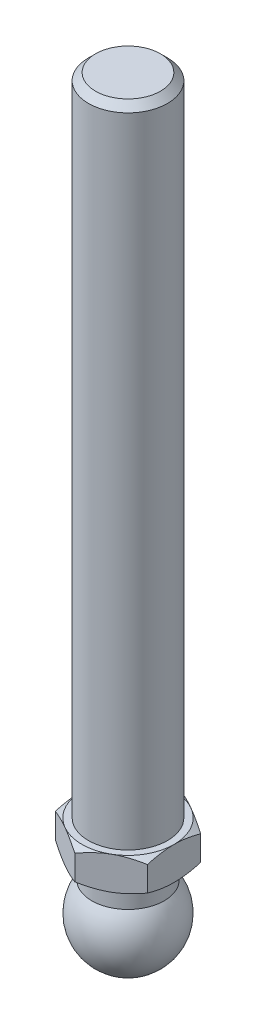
ISO-10303-21;
HEADER;
FILE_DESCRIPTION(('STEP AP214'),'2;1');
FILE_NAME('part.step','',(''),(''),'','','');
FILE_SCHEMA(('AUTOMOTIVE_DESIGN { 1 0 10303 214 1 1 1 1 }'));
ENDSEC;
DATA;
#1=APPLICATION_CONTEXT('core data for automotive mechanical design processes');
#2=APPLICATION_PROTOCOL_DEFINITION('international standard','automotive_design',2000,#1);
#3=PRODUCT_CONTEXT('',#1,'mechanical');
#4=PRODUCT('Part','Part','',(#3));
#5=PRODUCT_RELATED_PRODUCT_CATEGORY('part','',(#4));
#6=PRODUCT_DEFINITION_FORMATION('','',#4);
#7=PRODUCT_DEFINITION_CONTEXT('part definition',#1,'design');
#8=PRODUCT_DEFINITION('design','',#6,#7);
#9=PRODUCT_DEFINITION_SHAPE('','',#8);
#10=(LENGTH_UNIT() NAMED_UNIT(*) SI_UNIT(.MILLI.,.METRE.));
#11=(NAMED_UNIT(*) PLANE_ANGLE_UNIT() SI_UNIT($,.RADIAN.));
#12=(NAMED_UNIT(*) SI_UNIT($,.STERADIAN.) SOLID_ANGLE_UNIT());
#13=UNCERTAINTY_MEASURE_WITH_UNIT(LENGTH_MEASURE(1.E-05),#10,'distance_accuracy_value','');
#14=(GEOMETRIC_REPRESENTATION_CONTEXT(3) GLOBAL_UNCERTAINTY_ASSIGNED_CONTEXT((#13)) GLOBAL_UNIT_ASSIGNED_CONTEXT((#10,
#11,#12)) REPRESENTATION_CONTEXT('',''));
#15=CARTESIAN_POINT('',(0.,0.,0.));
#16=DIRECTION('',(0.,0.,1.));
#17=DIRECTION('',(1.,0.,0.));
#18=AXIS2_PLACEMENT_3D('',#15,#16,#17);
#19=CARTESIAN_POINT('',(0.,19.5,0.));
#20=DIRECTION('',(0.,-1.,0.));
#21=DIRECTION('',(0.,0.,-1.));
#22=AXIS2_PLACEMENT_3D('',#19,#20,#21);
#23=CONICAL_SURFACE('',#22,7.,1.0471975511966);
#24=CARTESIAN_POINT('',(-7.,15.2688336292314,12.5023453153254));
#25=CARTESIAN_POINT('',(-7.,15.4184696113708,12.2052647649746));
#26=CARTESIAN_POINT('',(-7.,15.5671267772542,11.9076861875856));
#27=CARTESIAN_POINT('',(-7.,15.8620076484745,11.3113035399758));
#28=CARTESIAN_POINT('',(-7.,16.0082312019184,11.0124993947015));
#29=CARTESIAN_POINT('',(-7.,16.2980281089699,10.4128982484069));
#30=CARTESIAN_POINT('',(-7.,16.441595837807,10.1120985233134));
#31=CARTESIAN_POINT('',(-7.,16.7251296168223,9.50881013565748));
#32=CARTESIAN_POINT('',(-7.,16.8650957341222,9.20632150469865));
#33=CARTESIAN_POINT('',(-7.,17.1470427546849,8.58510325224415));
#34=CARTESIAN_POINT('',(-7.,17.2888108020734,8.26627671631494));
#35=CARTESIAN_POINT('',(-7.,17.5662200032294,7.62594250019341));
#36=CARTESIAN_POINT('',(-7.,17.7018608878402,7.30443470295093));
#37=CARTESIAN_POINT('',(-7.,17.9652496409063,6.65840905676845));
#38=CARTESIAN_POINT('',(-7.,18.0930022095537,6.33389313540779));
#39=CARTESIAN_POINT('',(-7.,18.3384540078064,5.68109770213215));
#40=CARTESIAN_POINT('',(-7.,18.4561543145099,5.35281859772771));
#41=CARTESIAN_POINT('',(-7.,18.7028165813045,4.61998548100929));
#42=CARTESIAN_POINT('',(-7.,18.8286623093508,4.21436746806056));
#43=CARTESIAN_POINT('',(-7.,19.0543524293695,3.39574912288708));
#44=CARTESIAN_POINT('',(-7.,19.1541980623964,2.98274914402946));
#45=CARTESIAN_POINT('',(-7.,19.2776062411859,2.36178861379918));
#46=CARTESIAN_POINT('',(-7.,19.3141378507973,2.15638627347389));
#47=CARTESIAN_POINT('',(-7.,19.3780104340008,1.74416917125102));
#48=CARTESIAN_POINT('',(-7.,19.4053527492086,1.53735462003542));
#49=CARTESIAN_POINT('',(-7.,19.4500375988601,1.1227076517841));
#50=CARTESIAN_POINT('',(-7.,19.467383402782,0.914875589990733));
#51=CARTESIAN_POINT('',(-7.,19.4915250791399,0.498594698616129));
#52=CARTESIAN_POINT('',(-7.,19.4983210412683,0.290145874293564));
#53=CARTESIAN_POINT('',(-7.,19.5011397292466,-0.128421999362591));
#54=CARTESIAN_POINT('',(-7.,19.4970795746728,-0.338541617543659));
#55=CARTESIAN_POINT('',(-7.,19.4781521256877,-0.758289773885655));
#56=CARTESIAN_POINT('',(-7.,19.463284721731,-0.967918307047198));
#57=CARTESIAN_POINT('',(-7.,19.4232345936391,-1.38625975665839));
#58=CARTESIAN_POINT('',(-7.,19.3980479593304,-1.59497229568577));
#59=CARTESIAN_POINT('',(-7.,19.3381380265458,-2.01100790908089));
#60=CARTESIAN_POINT('',(-7.,19.3034145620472,-2.21833095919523));
#61=CARTESIAN_POINT('',(-7.,19.1849408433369,-2.84522045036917));
#62=CARTESIAN_POINT('',(-7.,19.0876569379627,-3.26225118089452));
#63=CARTESIAN_POINT('',(-7.,18.8658468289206,-4.08879182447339));
#64=CARTESIAN_POINT('',(-7.,18.7413180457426,-4.4983010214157));
#65=CARTESIAN_POINT('',(-7.,18.4953846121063,-5.2406101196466));
#66=CARTESIAN_POINT('',(-7.,18.3771372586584,-5.5744719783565));
#67=CARTESIAN_POINT('',(-7.,18.1300009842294,-6.23825206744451));
#68=CARTESIAN_POINT('',(-7.,18.0011107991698,-6.56816982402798));
#69=CARTESIAN_POINT('',(-7.,17.7350197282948,-7.22486424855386));
#70=CARTESIAN_POINT('',(-7.,17.5978135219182,-7.55163874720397));
#71=CARTESIAN_POINT('',(-7.,17.3169731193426,-8.20238370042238));
#72=CARTESIAN_POINT('',(-7.,17.1733392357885,-8.5263542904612));
#73=CARTESIAN_POINT('',(-7.,16.8876445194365,-9.15729037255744));
#74=CARTESIAN_POINT('',(-7.,16.7458097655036,-9.46435857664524));
#75=CARTESIAN_POINT('',(-7.,16.4583976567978,-10.0767426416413));
#76=CARTESIAN_POINT('',(-7.,16.3128202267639,-10.3820584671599));
#77=CARTESIAN_POINT('',(-7.,16.018926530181,-10.990585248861));
#78=CARTESIAN_POINT('',(-7.,15.8706165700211,-11.2937992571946));
#79=CARTESIAN_POINT('',(-7.,15.5714843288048,-11.8989613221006));
#80=CARTESIAN_POINT('',(-7.,15.4206622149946,-12.2009094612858));
#81=CARTESIAN_POINT('',(-7.,15.2688336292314,-12.5023453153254));
#82=B_SPLINE_CURVE_WITH_KNOTS('',3,(#24,#25,#26,#27,#28,#29,#30,#31,#32,#33,#34,#35,#36,#37,#38,
#39,#40,#41,#42,#43,#44,#45,#46,#47,#48,#49,#50,#51,#52,#53,#54,#55,#56,#57,#58,#59,#60,#61,#62,
#63,#64,#65,#66,#67,#68,#69,#70,#71,#72,#73,#74,#75,#76,#77,#78,#79,#80,#81),.UNSPECIFIED.,.F.,
.F.,(4,2,2,2,2,2,2,2,2,2,2,2,2,2,2,2,2,2,2,2,2,2,2,2,2,2,2,2,4),(0.,0.997917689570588,
1.99589743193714,2.99579247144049,3.99566886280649,5.04239250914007,6.08916209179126,
7.13530182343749,8.18132932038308,9.45480706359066,10.7282240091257,11.3539282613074,
11.9795411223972,12.6049492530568,13.2303520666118,13.8605430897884,14.490740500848,
15.1211769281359,15.7516243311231,17.0349275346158,18.3183522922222,19.380686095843,
20.4431462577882,21.506293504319,22.5693890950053,23.5840866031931,24.5988045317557,
25.6114179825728,26.6239642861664),.UNSPECIFIED.);
#83=CARTESIAN_POINT('',(-7.,18.8747852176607,4.04145188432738));
#84=VERTEX_POINT('',#83);
#85=CARTESIAN_POINT('',(-7.,19.5,0.));
#86=VERTEX_POINT('',#85);
#87=EDGE_CURVE('E359',#84,#86,#82,.T.);
#88=ORIENTED_EDGE('',*,*,#87,.F.);
#89=CARTESIAN_POINT('',(0.0002,18.8747185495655,8.0830192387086));
#90=CARTESIAN_POINT('',(-0.153667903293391,18.9260001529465,7.99418356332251));
#91=CARTESIAN_POINT('',(-0.30810950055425,18.9749544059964,7.90501666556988));
#92=CARTESIAN_POINT('',(-0.618246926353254,19.0675672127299,7.72595873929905));
#93=CARTESIAN_POINT('',(-0.773943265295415,19.1112234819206,7.63606741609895));
#94=CARTESIAN_POINT('',(-1.24352516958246,19.2333884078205,7.36495417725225));
#95=CARTESIAN_POINT('',(-1.5592643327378,19.302874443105,7.18266208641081));
#96=CARTESIAN_POINT('',(-2.03176224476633,19.3843550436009,6.9098652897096));
#97=CARTESIAN_POINT('',(-2.18710922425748,19.4075665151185,6.82017566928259));
#98=CARTESIAN_POINT('',(-2.49850511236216,19.4464887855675,6.64039116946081));
#99=CARTESIAN_POINT('',(-2.65455395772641,19.4622002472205,6.55029632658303));
#100=CARTESIAN_POINT('',(-2.96692267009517,19.4857220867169,6.36995016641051));
#101=CARTESIAN_POINT('',(-3.12324202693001,19.4935414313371,6.27969914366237));
#102=CARTESIAN_POINT('',(-3.43601650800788,19.5011197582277,6.09911871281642));
#103=CARTESIAN_POINT('',(-3.59247162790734,19.500878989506,6.00878930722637));
#104=CARTESIAN_POINT('',(-4.02110687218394,19.4891402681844,5.76131663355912));
#105=CARTESIAN_POINT('',(-4.2931466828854,19.4694342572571,5.60425437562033));
#106=CARTESIAN_POINT('',(-4.83541944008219,19.4069465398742,5.29117305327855));
#107=CARTESIAN_POINT('',(-5.10565047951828,19.364143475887,5.13515508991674));
#108=CARTESIAN_POINT('',(-5.64901454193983,19.2571483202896,4.82144370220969));
#109=CARTESIAN_POINT('',(-5.92207900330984,19.1925029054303,4.66378986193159));
#110=CARTESIAN_POINT('',(-6.46413578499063,19.045783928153,4.35083323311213));
#111=CARTESIAN_POINT('',(-6.73313504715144,18.9637448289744,4.19552643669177));
#112=CARTESIAN_POINT('',(-7.0002,18.8747185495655,4.04133641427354));
#113=B_SPLINE_CURVE_WITH_KNOTS('',3,(#89,#90,#91,#92,#93,#94,#95,#96,#97,#98,#99,#100,#101,#102,
#103,#104,#105,#106,#107,#108,#109,#110,#111,#112),.UNSPECIFIED.,.F.,.F.,(4,2,2,2,2,2,2,2,2,2,2,
4),(0.,0.554727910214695,1.10969417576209,2.2219327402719,2.76443041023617,3.30688013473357,
3.8487128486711,4.39052882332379,5.33376515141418,6.27787517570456,7.2429241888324,
8.20607866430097),.UNSPECIFIED.);
#114=CARTESIAN_POINT('',(-3.5,19.5,6.06217782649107));
#115=VERTEX_POINT('',#114);
#116=EDGE_CURVE('E148',#115,#84,#113,.T.);
#117=ORIENTED_EDGE('',*,*,#116,.F.);
#118=CARTESIAN_POINT('',(0.,19.5,0.));
#119=DIRECTION('',(0.,-1.,0.));
#120=DIRECTION('',(0.,0.,-1.));
#121=AXIS2_PLACEMENT_3D('',#118,#119,#120);
#122=CIRCLE('',#121,7.);
#123=EDGE_CURVE('E317',#115,#86,#122,.T.);
#124=ORIENTED_EDGE('',*,*,#123,.T.);
#125=EDGE_LOOP('',(#88,#117,#124));
#126=FACE_BOUND('',#125,.T.);
#127=ADVANCED_FACE('F18',(#126),#23,.T.);
#128=CARTESIAN_POINT('',(-7.,18.8747852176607,-4.04145188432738));
#129=VERTEX_POINT('',#128);
#130=EDGE_CURVE('E213',#86,#129,#82,.T.);
#131=ORIENTED_EDGE('',*,*,#130,.F.);
#132=CARTESIAN_POINT('',(-3.5,19.5,-6.06217782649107));
#133=VERTEX_POINT('',#132);
#134=EDGE_CURVE('E340',#86,#133,#122,.T.);
#135=ORIENTED_EDGE('',*,*,#134,.T.);
#136=CARTESIAN_POINT('',(-7.0002,18.8747185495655,-4.04133641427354));
#137=CARTESIAN_POINT('',(-6.84633209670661,18.9260001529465,-4.13017208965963));
#138=CARTESIAN_POINT('',(-6.69189049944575,18.9749544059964,-4.21933898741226));
#139=CARTESIAN_POINT('',(-6.38175307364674,19.0675672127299,-4.39839691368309));
#140=CARTESIAN_POINT('',(-6.22605673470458,19.1112234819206,-4.48828823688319));
#141=CARTESIAN_POINT('',(-5.75647483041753,19.2333884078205,-4.75940147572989));
#142=CARTESIAN_POINT('',(-5.4407356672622,19.302874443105,-4.94169356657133));
#143=CARTESIAN_POINT('',(-4.96823775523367,19.3843550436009,-5.21449036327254));
#144=CARTESIAN_POINT('',(-4.81289077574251,19.4075665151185,-5.30417998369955));
#145=CARTESIAN_POINT('',(-4.50149488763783,19.4464887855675,-5.48396448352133));
#146=CARTESIAN_POINT('',(-4.34544604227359,19.4622002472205,-5.57405932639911));
#147=CARTESIAN_POINT('',(-4.03307732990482,19.4857220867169,-5.75440548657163));
#148=CARTESIAN_POINT('',(-3.87675797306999,19.4935414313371,-5.84465650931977));
#149=CARTESIAN_POINT('',(-3.56398349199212,19.5011197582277,-6.02523694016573));
#150=CARTESIAN_POINT('',(-3.40752837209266,19.500878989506,-6.11556634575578));
#151=CARTESIAN_POINT('',(-2.97889312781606,19.4891402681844,-6.36303901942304));
#152=CARTESIAN_POINT('',(-2.7068533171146,19.4694342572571,-6.52010127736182));
#153=CARTESIAN_POINT('',(-2.1645805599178,19.4069465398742,-6.83318259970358));
#154=CARTESIAN_POINT('',(-1.89434952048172,19.364143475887,-6.9892005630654));
#155=CARTESIAN_POINT('',(-1.35098545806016,19.2571483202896,-7.30291195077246));
#156=CARTESIAN_POINT('',(-1.07792099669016,19.1925029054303,-7.46056579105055));
#157=CARTESIAN_POINT('',(-0.53586421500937,19.045783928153,-7.77352241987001));
#158=CARTESIAN_POINT('',(-0.26686495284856,18.9637448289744,-7.92882921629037));
#159=CARTESIAN_POINT('',(0.000200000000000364,18.8747185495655,-8.0830192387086));
#160=B_SPLINE_CURVE_WITH_KNOTS('',3,(#136,#137,#138,#139,#140,#141,#142,#143,#144,#145,#146,
#147,#148,#149,#150,#151,#152,#153,#154,#155,#156,#157,#158,#159),.UNSPECIFIED.,.F.,.F.,(4,2,2,
2,2,2,2,2,2,2,2,4),(0.,0.554727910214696,1.10969417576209,2.2219327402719,2.76443041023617,
3.30688013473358,3.8487128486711,4.39052882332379,5.33376515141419,6.27787517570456,
7.2429241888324,8.20607866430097),.UNSPECIFIED.);
#161=EDGE_CURVE('E205',#129,#133,#160,.T.);
#162=ORIENTED_EDGE('',*,*,#161,.F.);
#163=EDGE_LOOP('',(#131,#135,#162));
#164=FACE_BOUND('',#163,.T.);
#165=ADVANCED_FACE('F405',(#164),#23,.T.);
#166=CARTESIAN_POINT('',(0.,18.8747852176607,-8.08290376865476));
#167=VERTEX_POINT('',#166);
#168=EDGE_CURVE('E206',#133,#167,#160,.T.);
#169=ORIENTED_EDGE('',*,*,#168,.F.);
#170=CARTESIAN_POINT('',(3.5,19.5,-6.06217782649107));
#171=VERTEX_POINT('',#170);
#172=EDGE_CURVE('E331',#133,#171,#122,.T.);
#173=ORIENTED_EDGE('',*,*,#172,.T.);
#174=CARTESIAN_POINT('',(-0.0002,18.8747185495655,-8.0830192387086));
#175=CARTESIAN_POINT('',(0.153667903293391,18.9260001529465,-7.99418356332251));
#176=CARTESIAN_POINT('',(0.30810950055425,18.9749544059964,-7.90501666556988));
#177=CARTESIAN_POINT('',(0.618246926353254,19.0675672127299,-7.72595873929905));
#178=CARTESIAN_POINT('',(0.773943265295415,19.1112234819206,-7.63606741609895));
#179=CARTESIAN_POINT('',(1.24352516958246,19.2333884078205,-7.36495417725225));
#180=CARTESIAN_POINT('',(1.5592643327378,19.302874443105,-7.18266208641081));
#181=CARTESIAN_POINT('',(2.03176224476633,19.3843550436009,-6.9098652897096));
#182=CARTESIAN_POINT('',(2.18710922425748,19.4075665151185,-6.82017566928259));
#183=CARTESIAN_POINT('',(2.49850511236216,19.4464887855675,-6.64039116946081));
#184=CARTESIAN_POINT('',(2.65455395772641,19.4622002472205,-6.55029632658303));
#185=CARTESIAN_POINT('',(2.96692267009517,19.4857220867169,-6.36995016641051));
#186=CARTESIAN_POINT('',(3.12324202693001,19.4935414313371,-6.27969914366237));
#187=CARTESIAN_POINT('',(3.43601650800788,19.5011197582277,-6.09911871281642));
#188=CARTESIAN_POINT('',(3.59247162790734,19.500878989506,-6.00878930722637));
#189=CARTESIAN_POINT('',(4.02110687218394,19.4891402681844,-5.76131663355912));
#190=CARTESIAN_POINT('',(4.2931466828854,19.4694342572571,-5.60425437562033));
#191=CARTESIAN_POINT('',(4.83541944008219,19.4069465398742,-5.29117305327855));
#192=CARTESIAN_POINT('',(5.10565047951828,19.364143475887,-5.13515508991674));
#193=CARTESIAN_POINT('',(5.64901454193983,19.2571483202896,-4.82144370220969));
#194=CARTESIAN_POINT('',(5.92207900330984,19.1925029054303,-4.66378986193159));
#195=CARTESIAN_POINT('',(6.46413578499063,19.045783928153,-4.35083323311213));
#196=CARTESIAN_POINT('',(6.73313504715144,18.9637448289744,-4.19552643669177));
#197=CARTESIAN_POINT('',(7.0002,18.8747185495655,-4.04133641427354));
#198=B_SPLINE_CURVE_WITH_KNOTS('',3,(#174,#175,#176,#177,#178,#179,#180,#181,#182,#183,#184,
#185,#186,#187,#188,#189,#190,#191,#192,#193,#194,#195,#196,#197),.UNSPECIFIED.,.F.,.F.,(4,2,2,
2,2,2,2,2,2,2,2,4),(0.,0.554727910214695,1.10969417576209,2.2219327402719,2.76443041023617,
3.30688013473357,3.8487128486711,4.39052882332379,5.33376515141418,6.27787517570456,
7.2429241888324,8.20607866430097),.UNSPECIFIED.);
#199=EDGE_CURVE('E247',#167,#171,#198,.T.);
#200=ORIENTED_EDGE('',*,*,#199,.F.);
#201=EDGE_LOOP('',(#169,#173,#200));
#202=FACE_BOUND('',#201,.T.);
#203=ADVANCED_FACE('F410',(#202),#23,.T.);
#204=CARTESIAN_POINT('',(7.,18.8747852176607,-4.04145188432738));
#205=VERTEX_POINT('',#204);
#206=EDGE_CURVE('E248',#171,#205,#198,.T.);
#207=ORIENTED_EDGE('',*,*,#206,.F.);
#208=CARTESIAN_POINT('',(7.,19.5,0.));
#209=VERTEX_POINT('',#208);
#210=EDGE_CURVE('E324',#171,#209,#122,.T.);
#211=ORIENTED_EDGE('',*,*,#210,.T.);
#212=CARTESIAN_POINT('',(7.,15.2688336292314,-12.5023453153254));
#213=CARTESIAN_POINT('',(7.,15.4184696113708,-12.2052647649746));
#214=CARTESIAN_POINT('',(7.,15.5671267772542,-11.9076861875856));
#215=CARTESIAN_POINT('',(7.,15.8620076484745,-11.3113035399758));
#216=CARTESIAN_POINT('',(7.,16.0082312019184,-11.0124993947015));
#217=CARTESIAN_POINT('',(7.,16.2980281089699,-10.4128982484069));
#218=CARTESIAN_POINT('',(7.,16.441595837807,-10.1120985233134));
#219=CARTESIAN_POINT('',(7.,16.7251296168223,-9.50881013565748));
#220=CARTESIAN_POINT('',(7.,16.8650957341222,-9.20632150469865));
#221=CARTESIAN_POINT('',(7.,17.1470427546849,-8.58510325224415));
#222=CARTESIAN_POINT('',(7.,17.2888108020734,-8.26627671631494));
#223=CARTESIAN_POINT('',(7.,17.5662200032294,-7.62594250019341));
#224=CARTESIAN_POINT('',(7.,17.7018608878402,-7.30443470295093));
#225=CARTESIAN_POINT('',(7.,17.9652496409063,-6.65840905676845));
#226=CARTESIAN_POINT('',(7.,18.0930022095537,-6.33389313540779));
#227=CARTESIAN_POINT('',(7.,18.3384540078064,-5.68109770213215));
#228=CARTESIAN_POINT('',(7.,18.4561543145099,-5.35281859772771));
#229=CARTESIAN_POINT('',(7.,18.7028165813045,-4.61998548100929));
#230=CARTESIAN_POINT('',(7.,18.8286623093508,-4.21436746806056));
#231=CARTESIAN_POINT('',(7.,19.0543524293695,-3.39574912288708));
#232=CARTESIAN_POINT('',(7.,19.1541980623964,-2.98274914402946));
#233=CARTESIAN_POINT('',(7.,19.2776062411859,-2.36178861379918));
#234=CARTESIAN_POINT('',(7.,19.3141378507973,-2.15638627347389));
#235=CARTESIAN_POINT('',(7.,19.3780104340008,-1.74416917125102));
#236=CARTESIAN_POINT('',(7.,19.4053527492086,-1.53735462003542));
#237=CARTESIAN_POINT('',(7.,19.4500375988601,-1.1227076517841));
#238=CARTESIAN_POINT('',(7.,19.467383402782,-0.914875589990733));
#239=CARTESIAN_POINT('',(7.,19.4915250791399,-0.498594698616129));
#240=CARTESIAN_POINT('',(7.,19.4983210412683,-0.290145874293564));
#241=CARTESIAN_POINT('',(7.,19.5011397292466,0.128421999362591));
#242=CARTESIAN_POINT('',(7.,19.4970795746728,0.338541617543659));
#243=CARTESIAN_POINT('',(7.,19.4781521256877,0.758289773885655));
#244=CARTESIAN_POINT('',(7.,19.463284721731,0.967918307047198));
#245=CARTESIAN_POINT('',(7.,19.4232345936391,1.38625975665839));
#246=CARTESIAN_POINT('',(7.,19.3980479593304,1.59497229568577));
#247=CARTESIAN_POINT('',(7.,19.3381380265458,2.01100790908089));
#248=CARTESIAN_POINT('',(7.,19.3034145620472,2.21833095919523));
#249=CARTESIAN_POINT('',(7.,19.1849408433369,2.84522045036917));
#250=CARTESIAN_POINT('',(7.,19.0876569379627,3.26225118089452));
#251=CARTESIAN_POINT('',(7.,18.8658468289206,4.08879182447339));
#252=CARTESIAN_POINT('',(7.,18.7413180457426,4.4983010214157));
#253=CARTESIAN_POINT('',(7.,18.4953846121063,5.2406101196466));
#254=CARTESIAN_POINT('',(7.,18.3771372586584,5.5744719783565));
#255=CARTESIAN_POINT('',(7.,18.1300009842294,6.23825206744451));
#256=CARTESIAN_POINT('',(7.,18.0011107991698,6.56816982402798));
#257=CARTESIAN_POINT('',(7.,17.7350197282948,7.22486424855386));
#258=CARTESIAN_POINT('',(7.,17.5978135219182,7.55163874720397));
#259=CARTESIAN_POINT('',(7.,17.3169731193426,8.20238370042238));
#260=CARTESIAN_POINT('',(7.,17.1733392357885,8.5263542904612));
#261=CARTESIAN_POINT('',(7.,16.8876445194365,9.15729037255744));
#262=CARTESIAN_POINT('',(7.,16.7458097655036,9.46435857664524));
#263=CARTESIAN_POINT('',(7.,16.4583976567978,10.0767426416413));
#264=CARTESIAN_POINT('',(7.,16.3128202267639,10.3820584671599));
#265=CARTESIAN_POINT('',(7.,16.018926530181,10.990585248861));
#266=CARTESIAN_POINT('',(7.,15.8706165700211,11.2937992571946));
#267=CARTESIAN_POINT('',(7.,15.5714843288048,11.8989613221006));
#268=CARTESIAN_POINT('',(7.,15.4206622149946,12.2009094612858));
#269=CARTESIAN_POINT('',(7.,15.2688336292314,12.5023453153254));
#270=B_SPLINE_CURVE_WITH_KNOTS('',3,(#212,#213,#214,#215,#216,#217,#218,#219,#220,#221,#222,
#223,#224,#225,#226,#227,#228,#229,#230,#231,#232,#233,#234,#235,#236,#237,#238,#239,#240,#241,
#242,#243,#244,#245,#246,#247,#248,#249,#250,#251,#252,#253,#254,#255,#256,#257,#258,#259,#260,
#261,#262,#263,#264,#265,#266,#267,#268,#269),.UNSPECIFIED.,.F.,.F.,(4,2,2,2,2,2,2,2,2,2,2,2,2,
2,2,2,2,2,2,2,2,2,2,2,2,2,2,2,4),(0.,0.997917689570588,1.99589743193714,2.99579247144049,
3.99566886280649,5.04239250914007,6.08916209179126,7.13530182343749,8.18132932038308,
9.45480706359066,10.7282240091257,11.3539282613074,11.9795411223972,12.6049492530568,
13.2303520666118,13.8605430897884,14.490740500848,15.1211769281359,15.7516243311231,
17.0349275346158,18.3183522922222,19.380686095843,20.4431462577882,21.506293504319,
22.5693890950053,23.5840866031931,24.5988045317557,25.6114179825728,26.6239642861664),.UNSPECIFIED.);
#271=EDGE_CURVE('E270',#205,#209,#270,.T.);
#272=ORIENTED_EDGE('',*,*,#271,.F.);
#273=EDGE_LOOP('',(#207,#211,#272));
#274=FACE_BOUND('',#273,.T.);
#275=ADVANCED_FACE('F419',(#274),#23,.T.);
#276=CARTESIAN_POINT('',(7.,18.8747852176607,4.04145188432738));
#277=VERTEX_POINT('',#276);
#278=EDGE_CURVE('E271',#209,#277,#270,.T.);
#279=ORIENTED_EDGE('',*,*,#278,.F.);
#280=CARTESIAN_POINT('',(3.5,19.5,6.06217782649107));
#281=VERTEX_POINT('',#280);
#282=EDGE_CURVE('E314',#209,#281,#122,.T.);
#283=ORIENTED_EDGE('',*,*,#282,.T.);
#284=CARTESIAN_POINT('',(7.0002,18.8747185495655,4.04133641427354));
#285=CARTESIAN_POINT('',(6.84633209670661,18.9260001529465,4.13017208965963));
#286=CARTESIAN_POINT('',(6.69189049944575,18.9749544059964,4.21933898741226));
#287=CARTESIAN_POINT('',(6.38175307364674,19.0675672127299,4.39839691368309));
#288=CARTESIAN_POINT('',(6.22605673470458,19.1112234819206,4.48828823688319));
#289=CARTESIAN_POINT('',(5.75647483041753,19.2333884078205,4.75940147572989));
#290=CARTESIAN_POINT('',(5.4407356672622,19.302874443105,4.94169356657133));
#291=CARTESIAN_POINT('',(4.96823775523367,19.3843550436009,5.21449036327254));
#292=CARTESIAN_POINT('',(4.81289077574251,19.4075665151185,5.30417998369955));
#293=CARTESIAN_POINT('',(4.50149488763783,19.4464887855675,5.48396448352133));
#294=CARTESIAN_POINT('',(4.34544604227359,19.4622002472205,5.57405932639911));
#295=CARTESIAN_POINT('',(4.03307732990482,19.4857220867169,5.75440548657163));
#296=CARTESIAN_POINT('',(3.87675797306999,19.4935414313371,5.84465650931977));
#297=CARTESIAN_POINT('',(3.56398349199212,19.5011197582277,6.02523694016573));
#298=CARTESIAN_POINT('',(3.40752837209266,19.500878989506,6.11556634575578));
#299=CARTESIAN_POINT('',(2.97889312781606,19.4891402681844,6.36303901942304));
#300=CARTESIAN_POINT('',(2.7068533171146,19.4694342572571,6.52010127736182));
#301=CARTESIAN_POINT('',(2.1645805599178,19.4069465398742,6.83318259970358));
#302=CARTESIAN_POINT('',(1.89434952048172,19.364143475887,6.9892005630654));
#303=CARTESIAN_POINT('',(1.35098545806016,19.2571483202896,7.30291195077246));
#304=CARTESIAN_POINT('',(1.07792099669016,19.1925029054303,7.46056579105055));
#305=CARTESIAN_POINT('',(0.53586421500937,19.045783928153,7.77352241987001));
#306=CARTESIAN_POINT('',(0.26686495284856,18.9637448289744,7.92882921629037));
#307=CARTESIAN_POINT('',(-0.000200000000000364,18.8747185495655,8.0830192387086));
#308=B_SPLINE_CURVE_WITH_KNOTS('',3,(#284,#285,#286,#287,#288,#289,#290,#291,#292,#293,#294,
#295,#296,#297,#298,#299,#300,#301,#302,#303,#304,#305,#306,#307),.UNSPECIFIED.,.F.,.F.,(4,2,2,
2,2,2,2,2,2,2,2,4),(0.,0.554727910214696,1.10969417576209,2.2219327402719,2.76443041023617,
3.30688013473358,3.8487128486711,4.39052882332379,5.33376515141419,6.27787517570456,
7.2429241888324,8.20607866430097),.UNSPECIFIED.);
#309=EDGE_CURVE('E138',#277,#281,#308,.T.);
#310=ORIENTED_EDGE('',*,*,#309,.F.);
#311=EDGE_LOOP('',(#279,#283,#310));
#312=FACE_BOUND('',#311,.T.);
#313=ADVANCED_FACE('F320',(#312),#23,.T.);
#314=CARTESIAN_POINT('',(0.,18.8747852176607,8.08290376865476));
#315=VERTEX_POINT('',#314);
#316=EDGE_CURVE('E122',#281,#315,#308,.T.);
#317=ORIENTED_EDGE('',*,*,#316,.F.);
#318=EDGE_CURVE('E309',#281,#115,#122,.T.);
#319=ORIENTED_EDGE('',*,*,#318,.T.);
#320=EDGE_CURVE('E34',#315,#115,#113,.T.);
#321=ORIENTED_EDGE('',*,*,#320,.F.);
#322=EDGE_LOOP('',(#317,#319,#321));
#323=FACE_BOUND('',#322,.T.);
#324=ADVANCED_FACE('F308',(#323),#23,.T.);
#325=CARTESIAN_POINT('',(6.,19.5,0.));
#326=DIRECTION('',(0.,-1.,0.));
#327=DIRECTION('',(0.,0.,-1.));
#328=AXIS2_PLACEMENT_3D('',#325,#326,#327);
#329=PLANE('',#328);
#330=CARTESIAN_POINT('',(0.,19.5,0.));
#331=DIRECTION('',(0.,-1.,0.));
#332=DIRECTION('',(0.,0.,-1.));
#333=AXIS2_PLACEMENT_3D('',#330,#331,#332);
#334=CIRCLE('',#333,6.);
#335=CARTESIAN_POINT('',(0.,19.5,-6.));
#336=VERTEX_POINT('',#335);
#337=EDGE_CURVE('E323',#336,#336,#334,.F.);
#338=ORIENTED_EDGE('',*,*,#337,.F.);
#339=EDGE_LOOP('',(#338));
#340=FACE_BOUND('',#339,.T.);
#341=ORIENTED_EDGE('',*,*,#282,.F.);
#342=ORIENTED_EDGE('',*,*,#210,.F.);
#343=ORIENTED_EDGE('',*,*,#172,.F.);
#344=ORIENTED_EDGE('',*,*,#134,.F.);
#345=ORIENTED_EDGE('',*,*,#123,.F.);
#346=ORIENTED_EDGE('',*,*,#318,.F.);
#347=EDGE_LOOP('',(#341,#342,#343,#344,#345,#346));
#348=FACE_BOUND('',#347,.T.);
#349=ADVANCED_FACE('F227',(#340,#348),#329,.F.);
#350=CARTESIAN_POINT('',(-7.,14.3,-4.04145188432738));
#351=DIRECTION('',(-1.,0.,0.));
#352=DIRECTION('',(0.,0.,1.));
#353=AXIS2_PLACEMENT_3D('',#350,#351,#352);
#354=PLANE('',#353);
#355=ORIENTED_EDGE('',*,*,#87,.T.);
#356=ORIENTED_EDGE('',*,*,#130,.T.);
#357=DIRECTION('',(0.,1.,0.));
#358=VECTOR('',#357,1.);
#359=CARTESIAN_POINT('',(-7.,14.3,-4.04145188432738));
#360=LINE('',#359,#358);
#361=CARTESIAN_POINT('',(-7.,15.1252147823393,-4.04145188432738));
#362=VERTEX_POINT('',#361);
#363=EDGE_CURVE('E115',#362,#129,#360,.T.);
#364=ORIENTED_EDGE('',*,*,#363,.F.);
#365=CARTESIAN_POINT('',(-7.,18.7311663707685,-12.5023453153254));
#366=CARTESIAN_POINT('',(-7.,18.5815303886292,-12.2052647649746));
#367=CARTESIAN_POINT('',(-7.,18.4328732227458,-11.9076861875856));
#368=CARTESIAN_POINT('',(-7.,18.1379923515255,-11.3113035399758));
#369=CARTESIAN_POINT('',(-7.,17.9917687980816,-11.0124993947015));
#370=CARTESIAN_POINT('',(-7.,17.7019718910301,-10.4128982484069));
#371=CARTESIAN_POINT('',(-7.,17.558404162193,-10.1120985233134));
#372=CARTESIAN_POINT('',(-7.,17.2748703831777,-9.50881013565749));
#373=CARTESIAN_POINT('',(-7.,17.1349042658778,-9.20632150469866));
#374=CARTESIAN_POINT('',(-7.,16.8529572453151,-8.58510325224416));
#375=CARTESIAN_POINT('',(-7.,16.7111891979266,-8.26627671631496));
#376=CARTESIAN_POINT('',(-7.,16.4337799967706,-7.62594250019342));
#377=CARTESIAN_POINT('',(-7.,16.2981391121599,-7.30443470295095));
#378=CARTESIAN_POINT('',(-7.,16.0347503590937,-6.65840905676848));
#379=CARTESIAN_POINT('',(-7.,15.9069977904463,-6.33389313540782));
#380=CARTESIAN_POINT('',(-7.,15.6615459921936,-5.68109770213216));
#381=CARTESIAN_POINT('',(-7.,15.5438456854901,-5.35281859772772));
#382=CARTESIAN_POINT('',(-7.,15.2971834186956,-4.6199854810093));
#383=CARTESIAN_POINT('',(-7.,15.1713376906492,-4.21436746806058));
#384=CARTESIAN_POINT('',(-7.,14.9456475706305,-3.39574912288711));
#385=CARTESIAN_POINT('',(-7.,14.8458019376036,-2.98274914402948));
#386=CARTESIAN_POINT('',(-7.,14.7223937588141,-2.3617886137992));
#387=CARTESIAN_POINT('',(-7.,14.6858621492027,-2.1563862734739));
#388=CARTESIAN_POINT('',(-7.,14.6219895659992,-1.74416917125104));
#389=CARTESIAN_POINT('',(-7.,14.5946472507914,-1.53735462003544));
#390=CARTESIAN_POINT('',(-7.,14.5499624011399,-1.12270765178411));
#391=CARTESIAN_POINT('',(-7.,14.532616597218,-0.914875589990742));
#392=CARTESIAN_POINT('',(-7.,14.5084749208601,-0.498594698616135));
#393=CARTESIAN_POINT('',(-7.,14.5016789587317,-0.290145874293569));
#394=CARTESIAN_POINT('',(-7.,14.4988602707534,0.128421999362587));
#395=CARTESIAN_POINT('',(-7.,14.5029204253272,0.338541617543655));
#396=CARTESIAN_POINT('',(-7.,14.5218478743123,0.758289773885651));
#397=CARTESIAN_POINT('',(-7.,14.5367152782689,0.967918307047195));
#398=CARTESIAN_POINT('',(-7.,14.5767654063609,1.38625975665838));
#399=CARTESIAN_POINT('',(-7.,14.6019520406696,1.59497229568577));
#400=CARTESIAN_POINT('',(-7.,14.6618619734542,2.01100790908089));
#401=CARTESIAN_POINT('',(-7.,14.6965854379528,2.21833095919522));
#402=CARTESIAN_POINT('',(-7.,14.8150591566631,2.84522045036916));
#403=CARTESIAN_POINT('',(-7.,14.9123430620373,3.26225118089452));
#404=CARTESIAN_POINT('',(-7.,15.1341531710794,4.08879182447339));
#405=CARTESIAN_POINT('',(-7.,15.2586819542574,4.4983010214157));
#406=CARTESIAN_POINT('',(-7.,15.5046153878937,5.2406101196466));
#407=CARTESIAN_POINT('',(-7.,15.6228627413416,5.5744719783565));
#408=CARTESIAN_POINT('',(-7.,15.8699990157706,6.23825206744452));
#409=CARTESIAN_POINT('',(-7.,15.9988892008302,6.56816982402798));
#410=CARTESIAN_POINT('',(-7.,16.2649802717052,7.22486424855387));
#411=CARTESIAN_POINT('',(-7.,16.4021864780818,7.55163874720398));
#412=CARTESIAN_POINT('',(-7.,16.6830268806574,8.20238370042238));
#413=CARTESIAN_POINT('',(-7.,16.8266607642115,8.5263542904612));
#414=CARTESIAN_POINT('',(-7.,17.1123554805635,9.15729037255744));
#415=CARTESIAN_POINT('',(-7.,17.2541902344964,9.46435857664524));
#416=CARTESIAN_POINT('',(-7.,17.5416023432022,10.0767426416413));
#417=CARTESIAN_POINT('',(-7.,17.6871797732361,10.38205846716));
#418=CARTESIAN_POINT('',(-7.,17.981073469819,10.990585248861));
#419=CARTESIAN_POINT('',(-7.,18.1293834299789,11.2937992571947));
#420=CARTESIAN_POINT('',(-7.,18.4285156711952,11.8989613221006));
#421=CARTESIAN_POINT('',(-7.,18.5793377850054,12.2009094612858));
#422=CARTESIAN_POINT('',(-7.,18.7311663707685,12.5023453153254));
#423=B_SPLINE_CURVE_WITH_KNOTS('',3,(#365,#366,#367,#368,#369,#370,#371,#372,#373,#374,#375,
#376,#377,#378,#379,#380,#381,#382,#383,#384,#385,#386,#387,#388,#389,#390,#391,#392,#393,#394,
#395,#396,#397,#398,#399,#400,#401,#402,#403,#404,#405,#406,#407,#408,#409,#410,#411,#412,#413,
#414,#415,#416,#417,#418,#419,#420,#421,#422),.UNSPECIFIED.,.F.,.F.,(4,2,2,2,2,2,2,2,2,2,2,2,2,
2,2,2,2,2,2,2,2,2,2,2,2,2,2,2,4),(0.,0.997917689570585,1.99589743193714,2.99579247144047,
3.99566886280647,5.04239250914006,6.08916209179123,7.13530182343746,8.18132932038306,
9.45480706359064,10.7282240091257,11.3539282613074,11.9795411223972,12.6049492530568,
13.2303520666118,13.8605430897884,14.490740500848,15.1211769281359,15.7516243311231,
17.0349275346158,18.3183522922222,19.380686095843,20.4431462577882,21.506293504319,
22.5693890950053,23.5840866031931,24.5988045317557,25.6114179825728,26.6239642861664),.UNSPECIFIED.);
#424=CARTESIAN_POINT('',(-7.,14.5,0.));
#425=VERTEX_POINT('',#424);
#426=EDGE_CURVE('E204',#362,#425,#423,.T.);
#427=ORIENTED_EDGE('',*,*,#426,.T.);
#428=CARTESIAN_POINT('',(-7.,15.1252147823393,4.04145188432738));
#429=VERTEX_POINT('',#428);
#430=EDGE_CURVE('E194',#425,#429,#423,.T.);
#431=ORIENTED_EDGE('',*,*,#430,.T.);
#432=DIRECTION('',(0.,1.,0.));
#433=VECTOR('',#432,1.);
#434=CARTESIAN_POINT('',(-7.,14.3,4.04145188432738));
#435=LINE('',#434,#433);
#436=EDGE_CURVE('E125',#429,#84,#435,.T.);
#437=ORIENTED_EDGE('',*,*,#436,.T.);
#438=EDGE_LOOP('',(#355,#356,#364,#427,#431,#437));
#439=FACE_BOUND('',#438,.T.);
#440=ADVANCED_FACE('F222',(#439),#354,.T.);
#441=CARTESIAN_POINT('',(0.,14.3,-8.08290376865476));
#442=DIRECTION('',(-0.5,0.,-0.866025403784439));
#443=DIRECTION('',(-0.866025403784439,0.,0.5));
#444=AXIS2_PLACEMENT_3D('',#441,#442,#443);
#445=PLANE('',#444);
#446=ORIENTED_EDGE('',*,*,#161,.T.);
#447=ORIENTED_EDGE('',*,*,#168,.T.);
#448=DIRECTION('',(0.,1.,0.));
#449=VECTOR('',#448,1.);
#450=CARTESIAN_POINT('',(0.,14.3,-8.08290376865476));
#451=LINE('',#450,#449);
#452=CARTESIAN_POINT('',(0.,15.1252147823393,-8.08290376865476));
#453=VERTEX_POINT('',#452);
#454=EDGE_CURVE('E441',#453,#167,#451,.T.);
#455=ORIENTED_EDGE('',*,*,#454,.F.);
#456=CARTESIAN_POINT('',(0.000200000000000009,15.1252814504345,-8.0830192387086));
#457=CARTESIAN_POINT('',(-0.153667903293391,15.0739998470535,-7.99418356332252));
#458=CARTESIAN_POINT('',(-0.30810950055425,15.0250455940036,-7.90501666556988));
#459=CARTESIAN_POINT('',(-0.618246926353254,14.9324327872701,-7.72595873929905));
#460=CARTESIAN_POINT('',(-0.773943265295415,14.8887765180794,-7.63606741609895));
#461=CARTESIAN_POINT('',(-1.24352516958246,14.7666115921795,-7.36495417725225));
#462=CARTESIAN_POINT('',(-1.5592643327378,14.697125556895,-7.18266208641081));
#463=CARTESIAN_POINT('',(-2.03176224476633,14.6156449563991,-6.9098652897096));
#464=CARTESIAN_POINT('',(-2.18710922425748,14.5924334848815,-6.82017566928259));
#465=CARTESIAN_POINT('',(-2.49850511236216,14.5535112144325,-6.64039116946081));
#466=CARTESIAN_POINT('',(-2.65455395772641,14.5377997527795,-6.55029632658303));
#467=CARTESIAN_POINT('',(-2.96692267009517,14.5142779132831,-6.36995016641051));
#468=CARTESIAN_POINT('',(-3.12324202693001,14.5064585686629,-6.27969914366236));
#469=CARTESIAN_POINT('',(-3.43601650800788,14.4988802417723,-6.09911871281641));
#470=CARTESIAN_POINT('',(-3.59247162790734,14.499121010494,-6.00878930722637));
#471=CARTESIAN_POINT('',(-4.02110687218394,14.5108597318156,-5.76131663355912));
#472=CARTESIAN_POINT('',(-4.2931466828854,14.5305657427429,-5.60425437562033));
#473=CARTESIAN_POINT('',(-4.8354194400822,14.5930534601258,-5.29117305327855));
#474=CARTESIAN_POINT('',(-5.10565047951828,14.635856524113,-5.13515508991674));
#475=CARTESIAN_POINT('',(-5.64901454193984,14.7428516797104,-4.82144370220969));
#476=CARTESIAN_POINT('',(-5.92207900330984,14.8074970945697,-4.66378986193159));
#477=CARTESIAN_POINT('',(-6.46413578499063,14.954216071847,-4.35083323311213));
#478=CARTESIAN_POINT('',(-6.73313504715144,15.0362551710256,-4.19552643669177));
#479=CARTESIAN_POINT('',(-7.0002,15.1252814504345,-4.04133641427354));
#480=B_SPLINE_CURVE_WITH_KNOTS('',3,(#456,#457,#458,#459,#460,#461,#462,#463,#464,#465,#466,
#467,#468,#469,#470,#471,#472,#473,#474,#475,#476,#477,#478,#479),.UNSPECIFIED.,.F.,.F.,(4,2,2,
2,2,2,2,2,2,2,2,4),(0.,0.554727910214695,1.10969417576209,2.2219327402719,2.76443041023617,
3.30688013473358,3.8487128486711,4.39052882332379,5.33376515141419,6.27787517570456,
7.2429241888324,8.20607866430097),.UNSPECIFIED.);
#481=CARTESIAN_POINT('',(-3.5,14.5,-6.06217782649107));
#482=VERTEX_POINT('',#481);
#483=EDGE_CURVE('E246',#453,#482,#480,.T.);
#484=ORIENTED_EDGE('',*,*,#483,.T.);
#485=EDGE_CURVE('E238',#482,#362,#480,.T.);
#486=ORIENTED_EDGE('',*,*,#485,.T.);
#487=ORIENTED_EDGE('',*,*,#363,.T.);
#488=EDGE_LOOP('',(#446,#447,#455,#484,#486,#487));
#489=FACE_BOUND('',#488,.T.);
#490=ADVANCED_FACE('F226',(#489),#445,.T.);
#491=CARTESIAN_POINT('',(7.,14.3,-4.04145188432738));
#492=DIRECTION('',(0.5,0.,-0.866025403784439));
#493=DIRECTION('',(-0.866025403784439,0.,-0.5));
#494=AXIS2_PLACEMENT_3D('',#491,#492,#493);
#495=PLANE('',#494);
#496=ORIENTED_EDGE('',*,*,#199,.T.);
#497=ORIENTED_EDGE('',*,*,#206,.T.);
#498=DIRECTION('',(0.,1.,0.));
#499=VECTOR('',#498,1.);
#500=CARTESIAN_POINT('',(7.,14.3,-4.04145188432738));
#501=LINE('',#500,#499);
#502=CARTESIAN_POINT('',(7.,15.1252147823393,-4.04145188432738));
#503=VERTEX_POINT('',#502);
#504=EDGE_CURVE('E458',#503,#205,#501,.T.);
#505=ORIENTED_EDGE('',*,*,#504,.F.);
#506=CARTESIAN_POINT('',(7.0002,15.1252814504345,-4.04133641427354));
#507=CARTESIAN_POINT('',(6.84633209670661,15.0739998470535,-4.13017208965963));
#508=CARTESIAN_POINT('',(6.69189049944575,15.0250455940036,-4.21933898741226));
#509=CARTESIAN_POINT('',(6.38175307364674,14.9324327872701,-4.39839691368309));
#510=CARTESIAN_POINT('',(6.22605673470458,14.8887765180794,-4.48828823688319));
#511=CARTESIAN_POINT('',(5.75647483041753,14.7666115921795,-4.75940147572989));
#512=CARTESIAN_POINT('',(5.4407356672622,14.697125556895,-4.94169356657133));
#513=CARTESIAN_POINT('',(4.96823775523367,14.6156449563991,-5.21449036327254));
#514=CARTESIAN_POINT('',(4.81289077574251,14.5924334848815,-5.30417998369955));
#515=CARTESIAN_POINT('',(4.50149488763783,14.5535112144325,-5.48396448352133));
#516=CARTESIAN_POINT('',(4.34544604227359,14.5377997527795,-5.57405932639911));
#517=CARTESIAN_POINT('',(4.03307732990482,14.5142779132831,-5.75440548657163));
#518=CARTESIAN_POINT('',(3.87675797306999,14.5064585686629,-5.84465650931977));
#519=CARTESIAN_POINT('',(3.56398349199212,14.4988802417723,-6.02523694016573));
#520=CARTESIAN_POINT('',(3.40752837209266,14.499121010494,-6.11556634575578));
#521=CARTESIAN_POINT('',(2.97889312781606,14.5108597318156,-6.36303901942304));
#522=CARTESIAN_POINT('',(2.7068533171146,14.5305657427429,-6.52010127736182));
#523=CARTESIAN_POINT('',(2.1645805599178,14.5930534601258,-6.83318259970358));
#524=CARTESIAN_POINT('',(1.89434952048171,14.635856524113,-6.9892005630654));
#525=CARTESIAN_POINT('',(1.35098545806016,14.7428516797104,-7.30291195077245));
#526=CARTESIAN_POINT('',(1.07792099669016,14.8074970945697,-7.46056579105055));
#527=CARTESIAN_POINT('',(0.53586421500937,14.954216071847,-7.77352241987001));
#528=CARTESIAN_POINT('',(0.266864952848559,15.0362551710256,-7.92882921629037));
#529=CARTESIAN_POINT('',(-0.000199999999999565,15.1252814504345,-8.0830192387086));
#530=B_SPLINE_CURVE_WITH_KNOTS('',3,(#506,#507,#508,#509,#510,#511,#512,#513,#514,#515,#516,
#517,#518,#519,#520,#521,#522,#523,#524,#525,#526,#527,#528,#529),.UNSPECIFIED.,.F.,.F.,(4,2,2,
2,2,2,2,2,2,2,2,4),(0.,0.554727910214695,1.10969417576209,2.2219327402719,2.76443041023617,
3.30688013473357,3.8487128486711,4.39052882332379,5.33376515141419,6.27787517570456,
7.2429241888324,8.20607866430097),.UNSPECIFIED.);
#531=CARTESIAN_POINT('',(3.5,14.5,-6.06217782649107));
#532=VERTEX_POINT('',#531);
#533=EDGE_CURVE('E269',#503,#532,#530,.T.);
#534=ORIENTED_EDGE('',*,*,#533,.T.);
#535=EDGE_CURVE('E261',#532,#453,#530,.T.);
#536=ORIENTED_EDGE('',*,*,#535,.T.);
#537=ORIENTED_EDGE('',*,*,#454,.T.);
#538=EDGE_LOOP('',(#496,#497,#505,#534,#536,#537));
#539=FACE_BOUND('',#538,.T.);
#540=ADVANCED_FACE('F234',(#539),#495,.T.);
#541=CARTESIAN_POINT('',(7.,14.3,4.04145188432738));
#542=DIRECTION('',(1.,0.,0.));
#543=DIRECTION('',(0.,0.,-1.));
#544=AXIS2_PLACEMENT_3D('',#541,#542,#543);
#545=PLANE('',#544);
#546=ORIENTED_EDGE('',*,*,#271,.T.);
#547=ORIENTED_EDGE('',*,*,#278,.T.);
#548=DIRECTION('',(0.,1.,0.));
#549=VECTOR('',#548,1.);
#550=CARTESIAN_POINT('',(7.,14.3,4.04145188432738));
#551=LINE('',#550,#549);
#552=CARTESIAN_POINT('',(7.,15.1252147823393,4.04145188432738));
#553=VERTEX_POINT('',#552);
#554=EDGE_CURVE('E124',#553,#277,#551,.T.);
#555=ORIENTED_EDGE('',*,*,#554,.F.);
#556=CARTESIAN_POINT('',(7.,18.7311663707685,12.5023453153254));
#557=CARTESIAN_POINT('',(7.,18.5815303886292,12.2052647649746));
#558=CARTESIAN_POINT('',(7.,18.4328732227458,11.9076861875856));
#559=CARTESIAN_POINT('',(7.,18.1379923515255,11.3113035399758));
#560=CARTESIAN_POINT('',(7.,17.9917687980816,11.0124993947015));
#561=CARTESIAN_POINT('',(7.,17.7019718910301,10.4128982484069));
#562=CARTESIAN_POINT('',(7.,17.558404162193,10.1120985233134));
#563=CARTESIAN_POINT('',(7.,17.2748703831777,9.50881013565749));
#564=CARTESIAN_POINT('',(7.,17.1349042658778,9.20632150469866));
#565=CARTESIAN_POINT('',(7.,16.8529572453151,8.58510325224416));
#566=CARTESIAN_POINT('',(7.,16.7111891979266,8.26627671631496));
#567=CARTESIAN_POINT('',(7.,16.4337799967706,7.62594250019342));
#568=CARTESIAN_POINT('',(7.,16.2981391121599,7.30443470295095));
#569=CARTESIAN_POINT('',(7.,16.0347503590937,6.65840905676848));
#570=CARTESIAN_POINT('',(7.,15.9069977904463,6.33389313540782));
#571=CARTESIAN_POINT('',(7.,15.6615459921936,5.68109770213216));
#572=CARTESIAN_POINT('',(7.,15.5438456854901,5.35281859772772));
#573=CARTESIAN_POINT('',(7.,15.2971834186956,4.6199854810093));
#574=CARTESIAN_POINT('',(7.,15.1713376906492,4.21436746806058));
#575=CARTESIAN_POINT('',(7.,14.9456475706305,3.39574912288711));
#576=CARTESIAN_POINT('',(7.,14.8458019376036,2.98274914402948));
#577=CARTESIAN_POINT('',(7.,14.7223937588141,2.3617886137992));
#578=CARTESIAN_POINT('',(7.,14.6858621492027,2.1563862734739));
#579=CARTESIAN_POINT('',(7.,14.6219895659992,1.74416917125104));
#580=CARTESIAN_POINT('',(7.,14.5946472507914,1.53735462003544));
#581=CARTESIAN_POINT('',(7.,14.5499624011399,1.12270765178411));
#582=CARTESIAN_POINT('',(7.,14.532616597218,0.914875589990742));
#583=CARTESIAN_POINT('',(7.,14.5084749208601,0.498594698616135));
#584=CARTESIAN_POINT('',(7.,14.5016789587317,0.290145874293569));
#585=CARTESIAN_POINT('',(7.,14.4988602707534,-0.128421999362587));
#586=CARTESIAN_POINT('',(7.,14.5029204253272,-0.338541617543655));
#587=CARTESIAN_POINT('',(7.,14.5218478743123,-0.758289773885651));
#588=CARTESIAN_POINT('',(7.,14.5367152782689,-0.967918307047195));
#589=CARTESIAN_POINT('',(7.,14.5767654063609,-1.38625975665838));
#590=CARTESIAN_POINT('',(7.,14.6019520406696,-1.59497229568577));
#591=CARTESIAN_POINT('',(7.,14.6618619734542,-2.01100790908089));
#592=CARTESIAN_POINT('',(7.,14.6965854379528,-2.21833095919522));
#593=CARTESIAN_POINT('',(7.,14.8150591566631,-2.84522045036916));
#594=CARTESIAN_POINT('',(7.,14.9123430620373,-3.26225118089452));
#595=CARTESIAN_POINT('',(7.,15.1341531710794,-4.08879182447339));
#596=CARTESIAN_POINT('',(7.,15.2586819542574,-4.4983010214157));
#597=CARTESIAN_POINT('',(7.,15.5046153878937,-5.2406101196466));
#598=CARTESIAN_POINT('',(7.,15.6228627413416,-5.5744719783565));
#599=CARTESIAN_POINT('',(7.,15.8699990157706,-6.23825206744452));
#600=CARTESIAN_POINT('',(7.,15.9988892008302,-6.56816982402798));
#601=CARTESIAN_POINT('',(7.,16.2649802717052,-7.22486424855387));
#602=CARTESIAN_POINT('',(7.,16.4021864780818,-7.55163874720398));
#603=CARTESIAN_POINT('',(7.,16.6830268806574,-8.20238370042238));
#604=CARTESIAN_POINT('',(7.,16.8266607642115,-8.5263542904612));
#605=CARTESIAN_POINT('',(7.,17.1123554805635,-9.15729037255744));
#606=CARTESIAN_POINT('',(7.,17.2541902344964,-9.46435857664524));
#607=CARTESIAN_POINT('',(7.,17.5416023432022,-10.0767426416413));
#608=CARTESIAN_POINT('',(7.,17.6871797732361,-10.38205846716));
#609=CARTESIAN_POINT('',(7.,17.981073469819,-10.990585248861));
#610=CARTESIAN_POINT('',(7.,18.1293834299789,-11.2937992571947));
#611=CARTESIAN_POINT('',(7.,18.4285156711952,-11.8989613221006));
#612=CARTESIAN_POINT('',(7.,18.5793377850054,-12.2009094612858));
#613=CARTESIAN_POINT('',(7.,18.7311663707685,-12.5023453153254));
#614=B_SPLINE_CURVE_WITH_KNOTS('',3,(#556,#557,#558,#559,#560,#561,#562,#563,#564,#565,#566,
#567,#568,#569,#570,#571,#572,#573,#574,#575,#576,#577,#578,#579,#580,#581,#582,#583,#584,#585,
#586,#587,#588,#589,#590,#591,#592,#593,#594,#595,#596,#597,#598,#599,#600,#601,#602,#603,#604,
#605,#606,#607,#608,#609,#610,#611,#612,#613),.UNSPECIFIED.,.F.,.F.,(4,2,2,2,2,2,2,2,2,2,2,2,2,
2,2,2,2,2,2,2,2,2,2,2,2,2,2,2,4),(0.,0.997917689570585,1.99589743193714,2.99579247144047,
3.99566886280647,5.04239250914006,6.08916209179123,7.13530182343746,8.18132932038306,
9.45480706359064,10.7282240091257,11.3539282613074,11.9795411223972,12.6049492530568,
13.2303520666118,13.8605430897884,14.490740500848,15.1211769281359,15.7516243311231,
17.0349275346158,18.3183522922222,19.380686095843,20.4431462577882,21.506293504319,
22.5693890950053,23.5840866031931,24.5988045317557,25.6114179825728,26.6239642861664),.UNSPECIFIED.);
#615=CARTESIAN_POINT('',(7.,14.5,0.));
#616=VERTEX_POINT('',#615);
#617=EDGE_CURVE('E289',#553,#616,#614,.T.);
#618=ORIENTED_EDGE('',*,*,#617,.T.);
#619=EDGE_CURVE('E282',#616,#503,#614,.T.);
#620=ORIENTED_EDGE('',*,*,#619,.T.);
#621=ORIENTED_EDGE('',*,*,#504,.T.);
#622=EDGE_LOOP('',(#546,#547,#555,#618,#620,#621));
#623=FACE_BOUND('',#622,.T.);
#624=ADVANCED_FACE('F170',(#623),#545,.T.);
#625=CARTESIAN_POINT('',(0.,14.3,8.08290376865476));
#626=DIRECTION('',(0.5,0.,0.866025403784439));
#627=DIRECTION('',(0.866025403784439,0.,-0.5));
#628=AXIS2_PLACEMENT_3D('',#625,#626,#627);
#629=PLANE('',#628);
#630=ORIENTED_EDGE('',*,*,#309,.T.);
#631=ORIENTED_EDGE('',*,*,#316,.T.);
#632=DIRECTION('',(0.,1.,0.));
#633=VECTOR('',#632,1.);
#634=CARTESIAN_POINT('',(0.,14.3,8.08290376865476));
#635=LINE('',#634,#633);
#636=CARTESIAN_POINT('',(0.,15.1252147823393,8.08290376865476));
#637=VERTEX_POINT('',#636);
#638=EDGE_CURVE('E109',#637,#315,#635,.T.);
#639=ORIENTED_EDGE('',*,*,#638,.F.);
#640=CARTESIAN_POINT('',(-0.000200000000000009,15.1252814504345,8.0830192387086));
#641=CARTESIAN_POINT('',(0.153667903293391,15.0739998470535,7.99418356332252));
#642=CARTESIAN_POINT('',(0.30810950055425,15.0250455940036,7.90501666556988));
#643=CARTESIAN_POINT('',(0.618246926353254,14.9324327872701,7.72595873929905));
#644=CARTESIAN_POINT('',(0.773943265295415,14.8887765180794,7.63606741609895));
#645=CARTESIAN_POINT('',(1.24352516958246,14.7666115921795,7.36495417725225));
#646=CARTESIAN_POINT('',(1.5592643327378,14.697125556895,7.18266208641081));
#647=CARTESIAN_POINT('',(2.03176224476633,14.6156449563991,6.9098652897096));
#648=CARTESIAN_POINT('',(2.18710922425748,14.5924334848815,6.82017566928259));
#649=CARTESIAN_POINT('',(2.49850511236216,14.5535112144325,6.64039116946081));
#650=CARTESIAN_POINT('',(2.65455395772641,14.5377997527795,6.55029632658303));
#651=CARTESIAN_POINT('',(2.96692267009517,14.5142779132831,6.36995016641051));
#652=CARTESIAN_POINT('',(3.12324202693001,14.5064585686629,6.27969914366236));
#653=CARTESIAN_POINT('',(3.43601650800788,14.4988802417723,6.09911871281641));
#654=CARTESIAN_POINT('',(3.59247162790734,14.499121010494,6.00878930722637));
#655=CARTESIAN_POINT('',(4.02110687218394,14.5108597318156,5.76131663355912));
#656=CARTESIAN_POINT('',(4.2931466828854,14.5305657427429,5.60425437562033));
#657=CARTESIAN_POINT('',(4.8354194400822,14.5930534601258,5.29117305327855));
#658=CARTESIAN_POINT('',(5.10565047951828,14.635856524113,5.13515508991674));
#659=CARTESIAN_POINT('',(5.64901454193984,14.7428516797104,4.82144370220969));
#660=CARTESIAN_POINT('',(5.92207900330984,14.8074970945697,4.66378986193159));
#661=CARTESIAN_POINT('',(6.46413578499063,14.954216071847,4.35083323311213));
#662=CARTESIAN_POINT('',(6.73313504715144,15.0362551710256,4.19552643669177));
#663=CARTESIAN_POINT('',(7.0002,15.1252814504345,4.04133641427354));
#664=B_SPLINE_CURVE_WITH_KNOTS('',3,(#640,#641,#642,#643,#644,#645,#646,#647,#648,#649,#650,
#651,#652,#653,#654,#655,#656,#657,#658,#659,#660,#661,#662,#663),.UNSPECIFIED.,.F.,.F.,(4,2,2,
2,2,2,2,2,2,2,2,4),(0.,0.554727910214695,1.10969417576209,2.2219327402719,2.76443041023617,
3.30688013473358,3.8487128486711,4.39052882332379,5.33376515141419,6.27787517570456,
7.2429241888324,8.20607866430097),.UNSPECIFIED.);
#665=CARTESIAN_POINT('',(3.5,14.5,6.06217782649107));
#666=VERTEX_POINT('',#665);
#667=EDGE_CURVE('E119',#637,#666,#664,.T.);
#668=ORIENTED_EDGE('',*,*,#667,.T.);
#669=EDGE_CURVE('E132',#666,#553,#664,.T.);
#670=ORIENTED_EDGE('',*,*,#669,.T.);
#671=ORIENTED_EDGE('',*,*,#554,.T.);
#672=EDGE_LOOP('',(#630,#631,#639,#668,#670,#671));
#673=FACE_BOUND('',#672,.T.);
#674=ADVANCED_FACE('F118',(#673),#629,.T.);
#675=CARTESIAN_POINT('',(-7.,14.3,4.04145188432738));
#676=DIRECTION('',(-0.5,0.,0.866025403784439));
#677=DIRECTION('',(0.866025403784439,0.,0.5));
#678=AXIS2_PLACEMENT_3D('',#675,#676,#677);
#679=PLANE('',#678);
#680=ORIENTED_EDGE('',*,*,#320,.T.);
#681=ORIENTED_EDGE('',*,*,#116,.T.);
#682=ORIENTED_EDGE('',*,*,#436,.F.);
#683=CARTESIAN_POINT('',(-7.0002,15.1252814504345,4.04133641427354));
#684=CARTESIAN_POINT('',(-6.84633209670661,15.0739998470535,4.13017208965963));
#685=CARTESIAN_POINT('',(-6.69189049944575,15.0250455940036,4.21933898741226));
#686=CARTESIAN_POINT('',(-6.38175307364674,14.9324327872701,4.39839691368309));
#687=CARTESIAN_POINT('',(-6.22605673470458,14.8887765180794,4.48828823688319));
#688=CARTESIAN_POINT('',(-5.75647483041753,14.7666115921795,4.75940147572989));
#689=CARTESIAN_POINT('',(-5.4407356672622,14.697125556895,4.94169356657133));
#690=CARTESIAN_POINT('',(-4.96823775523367,14.6156449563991,5.21449036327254));
#691=CARTESIAN_POINT('',(-4.81289077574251,14.5924334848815,5.30417998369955));
#692=CARTESIAN_POINT('',(-4.50149488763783,14.5535112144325,5.48396448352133));
#693=CARTESIAN_POINT('',(-4.34544604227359,14.5377997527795,5.57405932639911));
#694=CARTESIAN_POINT('',(-4.03307732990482,14.5142779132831,5.75440548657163));
#695=CARTESIAN_POINT('',(-3.87675797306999,14.5064585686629,5.84465650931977));
#696=CARTESIAN_POINT('',(-3.56398349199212,14.4988802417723,6.02523694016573));
#697=CARTESIAN_POINT('',(-3.40752837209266,14.499121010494,6.11556634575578));
#698=CARTESIAN_POINT('',(-2.97889312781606,14.5108597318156,6.36303901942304));
#699=CARTESIAN_POINT('',(-2.7068533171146,14.5305657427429,6.52010127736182));
#700=CARTESIAN_POINT('',(-2.1645805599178,14.5930534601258,6.83318259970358));
#701=CARTESIAN_POINT('',(-1.89434952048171,14.635856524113,6.9892005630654));
#702=CARTESIAN_POINT('',(-1.35098545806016,14.7428516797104,7.30291195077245));
#703=CARTESIAN_POINT('',(-1.07792099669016,14.8074970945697,7.46056579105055));
#704=CARTESIAN_POINT('',(-0.53586421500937,14.954216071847,7.77352241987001));
#705=CARTESIAN_POINT('',(-0.266864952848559,15.0362551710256,7.92882921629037));
#706=CARTESIAN_POINT('',(0.000199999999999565,15.1252814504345,8.0830192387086));
#707=B_SPLINE_CURVE_WITH_KNOTS('',3,(#683,#684,#685,#686,#687,#688,#689,#690,#691,#692,#693,
#694,#695,#696,#697,#698,#699,#700,#701,#702,#703,#704,#705,#706),.UNSPECIFIED.,.F.,.F.,(4,2,2,
2,2,2,2,2,2,2,2,4),(0.,0.554727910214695,1.10969417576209,2.2219327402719,2.76443041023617,
3.30688013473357,3.8487128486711,4.39052882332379,5.33376515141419,6.27787517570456,
7.2429241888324,8.20607866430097),.UNSPECIFIED.);
#708=CARTESIAN_POINT('',(-3.5,14.5,6.06217782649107));
#709=VERTEX_POINT('',#708);
#710=EDGE_CURVE('E41',#429,#709,#707,.T.);
#711=ORIENTED_EDGE('',*,*,#710,.T.);
#712=EDGE_CURVE('E106',#709,#637,#707,.T.);
#713=ORIENTED_EDGE('',*,*,#712,.T.);
#714=ORIENTED_EDGE('',*,*,#638,.T.);
#715=EDGE_LOOP('',(#680,#681,#682,#711,#713,#714));
#716=FACE_BOUND('',#715,.T.);
#717=ADVANCED_FACE('F108',(#716),#679,.T.);
#718=CARTESIAN_POINT('',(0.,0.,0.));
#719=DIRECTION('',(0.,-1.,0.));
#720=DIRECTION('',(0.,0.,-1.));
#721=AXIS2_PLACEMENT_3D('',#718,#719,#720);
#722=CYLINDRICAL_SURFACE('',#721,5.5);
#723=CARTESIAN_POINT('',(0.,11.3301270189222,0.));
#724=DIRECTION('',(0.,-1.,0.));
#725=DIRECTION('',(0.,0.,-1.));
#726=AXIS2_PLACEMENT_3D('',#723,#724,#725);
#727=CIRCLE('',#726,5.5);
#728=CARTESIAN_POINT('',(0.,11.3301270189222,-5.5));
#729=VERTEX_POINT('',#728);
#730=EDGE_CURVE('E469',#729,#729,#727,.T.);
#731=ORIENTED_EDGE('',*,*,#730,.F.);
#732=EDGE_LOOP('',(#731));
#733=FACE_BOUND('',#732,.T.);
#734=CARTESIAN_POINT('',(0.,14.5,0.));
#735=DIRECTION('',(0.,-1.,0.));
#736=DIRECTION('',(0.,0.,-1.));
#737=AXIS2_PLACEMENT_3D('',#734,#735,#736);
#738=CIRCLE('',#737,5.5);
#739=CARTESIAN_POINT('',(0.,14.5,-5.5));
#740=VERTEX_POINT('',#739);
#741=EDGE_CURVE('E351',#740,#740,#738,.T.);
#742=ORIENTED_EDGE('',*,*,#741,.T.);
#743=EDGE_LOOP('',(#742));
#744=FACE_BOUND('',#743,.T.);
#745=ADVANCED_FACE('F177',(#733,#744),#722,.T.);
#746=CARTESIAN_POINT('',(0.,17.,0.));
#747=DIRECTION('',(0.,1.,0.));
#748=DIRECTION('',(0.,0.,1.));
#749=AXIS2_PLACEMENT_3D('',#746,#747,#748);
#750=CONICAL_SURFACE('',#749,11.3301270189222,1.0471975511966);
#751=ORIENTED_EDGE('',*,*,#533,.F.);
#752=ORIENTED_EDGE('',*,*,#619,.F.);
#753=CARTESIAN_POINT('',(0.,14.5,0.));
#754=DIRECTION('',(0.,-1.,0.));
#755=DIRECTION('',(0.,0.,-1.));
#756=AXIS2_PLACEMENT_3D('',#753,#754,#755);
#757=CIRCLE('',#756,7.);
#758=EDGE_CURVE('E341',#532,#616,#757,.T.);
#759=ORIENTED_EDGE('',*,*,#758,.F.);
#760=EDGE_LOOP('',(#751,#752,#759));
#761=FACE_BOUND('',#760,.T.);
#762=ADVANCED_FACE('F164',(#761),#750,.T.);
#763=ORIENTED_EDGE('',*,*,#535,.F.);
#764=EDGE_CURVE('E350',#482,#532,#757,.T.);
#765=ORIENTED_EDGE('',*,*,#764,.F.);
#766=ORIENTED_EDGE('',*,*,#483,.F.);
#767=EDGE_LOOP('',(#763,#765,#766));
#768=FACE_BOUND('',#767,.T.);
#769=ADVANCED_FACE('F444',(#768),#750,.T.);
#770=ORIENTED_EDGE('',*,*,#485,.F.);
#771=EDGE_CURVE('E357',#425,#482,#757,.T.);
#772=ORIENTED_EDGE('',*,*,#771,.F.);
#773=ORIENTED_EDGE('',*,*,#426,.F.);
#774=EDGE_LOOP('',(#770,#772,#773));
#775=FACE_BOUND('',#774,.T.);
#776=ADVANCED_FACE('F384',(#775),#750,.T.);
#777=ORIENTED_EDGE('',*,*,#430,.F.);
#778=EDGE_CURVE('E347',#709,#425,#757,.T.);
#779=ORIENTED_EDGE('',*,*,#778,.F.);
#780=ORIENTED_EDGE('',*,*,#710,.F.);
#781=EDGE_LOOP('',(#777,#779,#780));
#782=FACE_BOUND('',#781,.T.);
#783=ADVANCED_FACE('F381',(#782),#750,.T.);
#784=ORIENTED_EDGE('',*,*,#617,.F.);
#785=ORIENTED_EDGE('',*,*,#669,.F.);
#786=EDGE_CURVE('E332',#616,#666,#757,.T.);
#787=ORIENTED_EDGE('',*,*,#786,.F.);
#788=EDGE_LOOP('',(#784,#785,#787));
#789=FACE_BOUND('',#788,.T.);
#790=ADVANCED_FACE('F396',(#789),#750,.T.);
#791=CARTESIAN_POINT('',(7.,14.5,0.));
#792=DIRECTION('',(0.,1.,0.));
#793=DIRECTION('',(0.,0.,1.));
#794=AXIS2_PLACEMENT_3D('',#791,#792,#793);
#795=PLANE('',#794);
#796=ORIENTED_EDGE('',*,*,#741,.F.);
#797=EDGE_LOOP('',(#796));
#798=FACE_BOUND('',#797,.T.);
#799=ORIENTED_EDGE('',*,*,#758,.T.);
#800=ORIENTED_EDGE('',*,*,#786,.T.);
#801=EDGE_CURVE('E129',#666,#709,#757,.T.);
#802=ORIENTED_EDGE('',*,*,#801,.T.);
#803=ORIENTED_EDGE('',*,*,#778,.T.);
#804=ORIENTED_EDGE('',*,*,#771,.T.);
#805=ORIENTED_EDGE('',*,*,#764,.T.);
#806=EDGE_LOOP('',(#799,#800,#802,#803,#804,#805));
#807=FACE_BOUND('',#806,.T.);
#808=ADVANCED_FACE('F387',(#798,#807),#795,.F.);
#809=ORIENTED_EDGE('',*,*,#667,.F.);
#810=ORIENTED_EDGE('',*,*,#712,.F.);
#811=ORIENTED_EDGE('',*,*,#801,.F.);
#812=EDGE_LOOP('',(#809,#810,#811));
#813=FACE_BOUND('',#812,.T.);
#814=ADVANCED_FACE('F127',(#813),#750,.T.);
#815=CARTESIAN_POINT('',(0.,7.,0.));
#816=DIRECTION('',(0.,-1.,0.));
#817=DIRECTION('',(-1.,0.,0.));
#818=AXIS2_PLACEMENT_3D('',#815,#816,#817);
#819=SPHERICAL_SURFACE('',#818,7.);
#820=ORIENTED_EDGE('',*,*,#730,.T.);
#821=EDGE_LOOP('',(#820));
#822=FACE_BOUND('',#821,.T.);
#823=ADVANCED_FACE('F229',(#822),#819,.T.);
#824=CARTESIAN_POINT('',(0.,117.5,0.));
#825=DIRECTION('',(0.,-1.,0.));
#826=DIRECTION('',(0.,0.,-1.));
#827=AXIS2_PLACEMENT_3D('',#824,#825,#826);
#828=CYLINDRICAL_SURFACE('',#827,6.);
#829=CARTESIAN_POINT('',(0.,116.4265,0.));
#830=DIRECTION('',(0.,1.,0.));
#831=DIRECTION('',(0.,0.,1.));
#832=AXIS2_PLACEMENT_3D('',#829,#830,#831);
#833=CIRCLE('',#832,6.);
#834=CARTESIAN_POINT('',(0.,116.4265,6.));
#835=VERTEX_POINT('',#834);
#836=EDGE_CURVE('E11',#835,#835,#833,.F.);
#837=ORIENTED_EDGE('',*,*,#836,.T.);
#838=EDGE_LOOP('',(#837));
#839=FACE_BOUND('',#838,.T.);
#840=ORIENTED_EDGE('',*,*,#337,.T.);
#841=EDGE_LOOP('',(#840));
#842=FACE_BOUND('',#841,.T.);
#843=ADVANCED_FACE('F634',(#839,#842),#828,.T.);
#844=CARTESIAN_POINT('',(0.,117.5,0.));
#845=DIRECTION('',(0.,1.,0.));
#846=DIRECTION('',(0.,0.,1.));
#847=AXIS2_PLACEMENT_3D('',#844,#845,#846);
#848=PLANE('',#847);
#849=CARTESIAN_POINT('',(0.,117.5,0.));
#850=DIRECTION('',(0.,1.,0.));
#851=DIRECTION('',(0.,0.,1.));
#852=AXIS2_PLACEMENT_3D('',#849,#850,#851);
#853=CIRCLE('',#852,4.9265);
#854=CARTESIAN_POINT('',(0.,117.5,4.9265));
#855=VERTEX_POINT('',#854);
#856=EDGE_CURVE('E27',#855,#855,#853,.T.);
#857=ORIENTED_EDGE('',*,*,#856,.T.);
#858=EDGE_LOOP('',(#857));
#859=FACE_BOUND('',#858,.T.);
#860=ADVANCED_FACE('F642',(#859),#848,.T.);
#861=CARTESIAN_POINT('',(0.,117.5,0.));
#862=DIRECTION('',(0.,-1.,0.));
#863=DIRECTION('',(0.,0.,-1.));
#864=AXIS2_PLACEMENT_3D('',#861,#862,#863);
#865=CONICAL_SURFACE('',#864,4.9265,0.785398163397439);
#866=ORIENTED_EDGE('',*,*,#836,.F.);
#867=EDGE_LOOP('',(#866));
#868=FACE_BOUND('',#867,.T.);
#869=ORIENTED_EDGE('',*,*,#856,.F.);
#870=EDGE_LOOP('',(#869));
#871=FACE_BOUND('',#870,.T.);
#872=ADVANCED_FACE('F21',(#868,#871),#865,.T.);
#873=CLOSED_SHELL('',(#127,#165,#203,#275,#313,#324,#349,#440,#490,#540,#624,#674,#717,#745,
#762,#769,#776,#783,#790,#808,#814,#823,#843,#860,#872));
#874=MANIFOLD_SOLID_BREP('B1',#873);
#875=ADVANCED_BREP_SHAPE_REPRESENTATION('',(#18,#874),#14);
#876=SHAPE_DEFINITION_REPRESENTATION(#9,#875);
ENDSEC;
END-ISO-10303-21;
